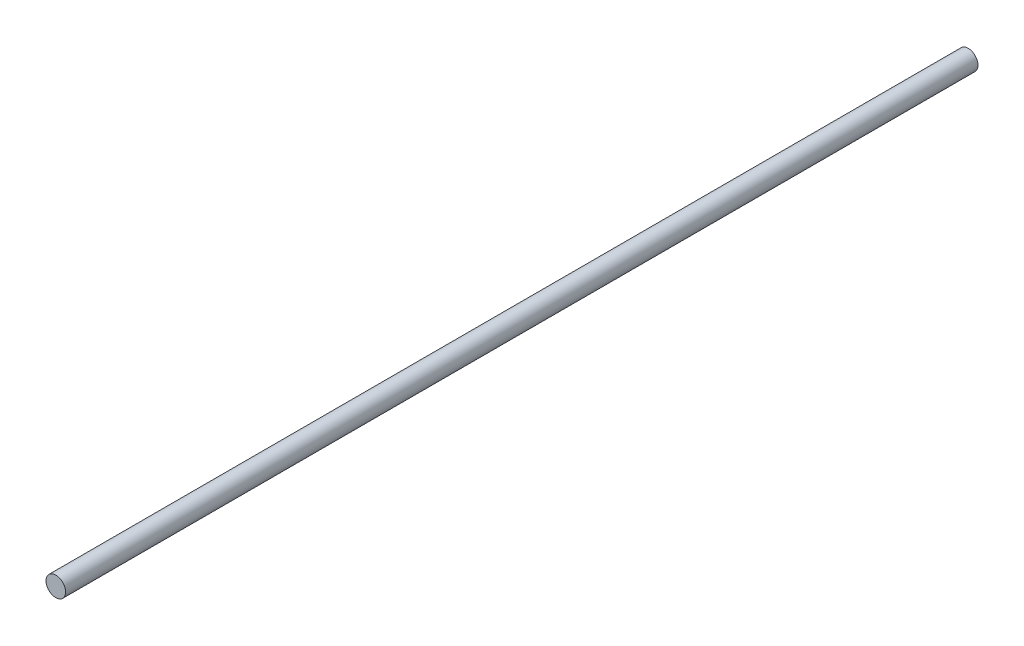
from build123d import *

# Parameters (mm, degrees)
SKETCH1_R           = 3
BOSS_EXTRUDE1_DEPTH = 279.4


with BuildPart() as part:
    # Sketch1 → Boss-Extrude1 (new body)
    with BuildSketch(Plane.XY):
        Circle(SKETCH1_R)
    extrude(amount=BOSS_EXTRUDE1_DEPTH)


solid = part.part
